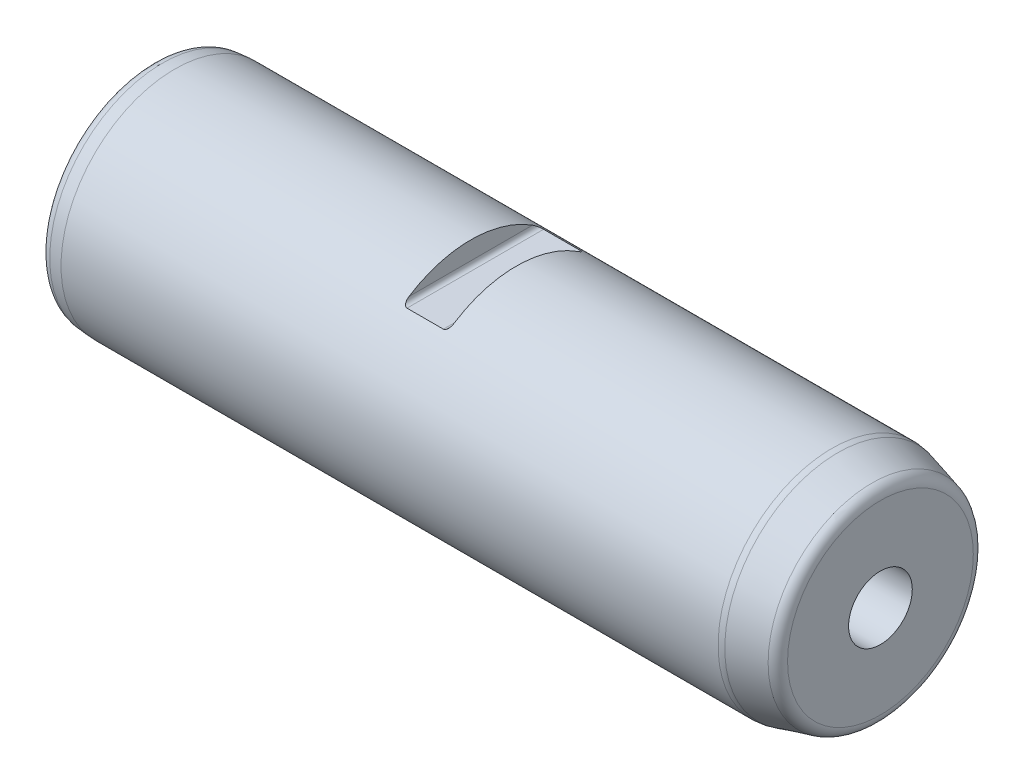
ISO-10303-21;
HEADER;
FILE_DESCRIPTION(('STEP AP214'),'2;1');
FILE_NAME('part.step','',(''),(''),'','','');
FILE_SCHEMA(('AUTOMOTIVE_DESIGN { 1 0 10303 214 1 1 1 1 }'));
ENDSEC;
DATA;
#1=APPLICATION_CONTEXT('core data for automotive mechanical design processes');
#2=APPLICATION_PROTOCOL_DEFINITION('international standard','automotive_design',2000,#1);
#3=PRODUCT_CONTEXT('',#1,'mechanical');
#4=PRODUCT('Part','Part','',(#3));
#5=PRODUCT_RELATED_PRODUCT_CATEGORY('part','',(#4));
#6=PRODUCT_DEFINITION_FORMATION('','',#4);
#7=PRODUCT_DEFINITION_CONTEXT('part definition',#1,'design');
#8=PRODUCT_DEFINITION('design','',#6,#7);
#9=PRODUCT_DEFINITION_SHAPE('','',#8);
#10=(LENGTH_UNIT() NAMED_UNIT(*) SI_UNIT(.MILLI.,.METRE.));
#11=(NAMED_UNIT(*) PLANE_ANGLE_UNIT() SI_UNIT($,.RADIAN.));
#12=(NAMED_UNIT(*) SI_UNIT($,.STERADIAN.) SOLID_ANGLE_UNIT());
#13=UNCERTAINTY_MEASURE_WITH_UNIT(LENGTH_MEASURE(1.E-05),#10,'distance_accuracy_value','');
#14=(GEOMETRIC_REPRESENTATION_CONTEXT(3) GLOBAL_UNCERTAINTY_ASSIGNED_CONTEXT((#13)) GLOBAL_UNIT_ASSIGNED_CONTEXT((#10,
#11,#12)) REPRESENTATION_CONTEXT('',''));
#15=CARTESIAN_POINT('',(0.,0.,0.));
#16=DIRECTION('',(0.,0.,1.));
#17=DIRECTION('',(1.,0.,0.));
#18=AXIS2_PLACEMENT_3D('',#15,#16,#17);
#19=CARTESIAN_POINT('',(0.,0.,0.));
#20=DIRECTION('',(1.,0.,0.));
#21=DIRECTION('',(0.,0.,-1.));
#22=AXIS2_PLACEMENT_3D('',#19,#20,#21);
#23=PLANE('',#22);
#24=CARTESIAN_POINT('',(0.,0.,0.));
#25=DIRECTION('',(1.,0.,0.));
#26=DIRECTION('',(0.,0.,-1.));
#27=AXIS2_PLACEMENT_3D('',#24,#25,#26);
#28=CIRCLE('',#27,22.2717287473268);
#29=CARTESIAN_POINT('',(0.,0.,-22.2717287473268));
#30=VERTEX_POINT('',#29);
#31=EDGE_CURVE('E160',#30,#30,#28,.F.);
#32=ORIENTED_EDGE('',*,*,#31,.T.);
#33=EDGE_LOOP('',(#32));
#34=FACE_BOUND('',#33,.T.);
#35=ADVANCED_FACE('F15',(#34),#23,.F.);
#36=CARTESIAN_POINT('',(0.,0.,0.));
#37=DIRECTION('',(-1.,0.,0.));
#38=DIRECTION('',(0.,0.,1.));
#39=AXIS2_PLACEMENT_3D('',#36,#37,#38);
#40=CYLINDRICAL_SURFACE('',#39,25.);
#41=CARTESIAN_POINT('',(79.,20.,-15.));
#42=CARTESIAN_POINT('',(79.0204326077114,19.9999962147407,-15.0000046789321));
#43=CARTESIAN_POINT('',(79.0408503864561,20.0006268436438,-14.99916423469));
#44=CARTESIAN_POINT('',(79.0814530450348,20.0031161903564,-14.9958444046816));
#45=CARTESIAN_POINT('',(79.1016381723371,20.0049734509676,-14.993366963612));
#46=CARTESIAN_POINT('',(79.1611193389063,20.0122659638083,-14.9836336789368));
#47=CARTESIAN_POINT('',(79.1998541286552,20.0194241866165,-14.9740740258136));
#48=CARTESIAN_POINT('',(79.274391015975,20.0376163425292,-14.9497209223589));
#49=CARTESIAN_POINT('',(79.3102051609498,20.048633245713,-14.9349504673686));
#50=CARTESIAN_POINT('',(79.378696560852,20.0737580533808,-14.9011638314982));
#51=CARTESIAN_POINT('',(79.411363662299,20.0878755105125,-14.8821345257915));
#52=CARTESIAN_POINT('',(79.4896711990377,20.1264955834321,-14.8298921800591));
#53=CARTESIAN_POINT('',(79.5330744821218,20.1525500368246,-14.7944897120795));
#54=CARTESIAN_POINT('',(79.612543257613,20.2080720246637,-14.7185614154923));
#55=CARTESIAN_POINT('',(79.6485941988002,20.2375461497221,-14.6780256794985));
#56=CARTESIAN_POINT('',(79.707944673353,20.2928022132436,-14.6015056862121));
#57=CARTESIAN_POINT('',(79.7323659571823,20.3182250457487,-14.5661150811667));
#58=CARTESIAN_POINT('',(79.7773623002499,20.3700125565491,-14.4936048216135));
#59=CARTESIAN_POINT('',(79.7979348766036,20.3963778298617,-14.4564840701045));
#60=CARTESIAN_POINT('',(79.8545876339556,20.4765627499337,-14.3429056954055));
#61=CARTESIAN_POINT('',(79.8854357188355,20.5313064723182,-14.2644598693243));
#62=CARTESIAN_POINT('',(79.926216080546,20.6210933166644,-14.1341533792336));
#63=CARTESIAN_POINT('',(79.9396653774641,20.655945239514,-14.0831742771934));
#64=CARTESIAN_POINT('',(79.9623501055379,20.7257206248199,-13.9802847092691));
#65=CARTESIAN_POINT('',(79.9715835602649,20.760644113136,-13.9283738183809));
#66=CARTESIAN_POINT('',(79.986039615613,20.829829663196,-13.8246889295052));
#67=CARTESIAN_POINT('',(79.9913190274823,20.8640939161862,-13.7729240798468));
#68=CARTESIAN_POINT('',(79.9982907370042,20.9323059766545,-13.6690320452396));
#69=CARTESIAN_POINT('',(79.9999872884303,20.9662541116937,-13.6169053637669));
#70=CARTESIAN_POINT('',(80.,21.,-13.5646599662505));
#71=B_SPLINE_CURVE_WITH_KNOTS('',3,(#41,#42,#43,#44,#45,#46,#47,#48,#49,#50,#51,#52,#53,#54,#55,
#56,#57,#58,#59,#60,#61,#62,#63,#64,#65,#66,#67,#68,#69,#70),.UNSPECIFIED.,.F.,.F.,(4,2,2,2,2,2,
2,2,2,2,2,2,2,2,4),(0.,0.0612433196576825,0.122414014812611,0.243243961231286,0.363547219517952,
0.48422645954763,0.66851208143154,0.853158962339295,1.00280656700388,1.15255038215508,
1.4530090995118,1.64250050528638,1.83208065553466,2.01888173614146,2.20546091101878),.UNSPECIFIED.);
#72=CARTESIAN_POINT('',(79.,20.,-15.));
#73=VERTEX_POINT('',#72);
#74=CARTESIAN_POINT('',(80.,21.,-13.5646599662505));
#75=VERTEX_POINT('',#74);
#76=EDGE_CURVE('E206',#73,#75,#71,.T.);
#77=ORIENTED_EDGE('',*,*,#76,.T.);
#78=CARTESIAN_POINT('',(80.,0.,0.));
#79=DIRECTION('',(1.,0.,0.));
#80=DIRECTION('',(0.,0.,-1.));
#81=AXIS2_PLACEMENT_3D('',#78,#79,#80);
#82=CIRCLE('',#81,25.);
#83=CARTESIAN_POINT('',(80.,21.,13.5646599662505));
#84=VERTEX_POINT('',#83);
#85=EDGE_CURVE('E9',#75,#84,#82,.T.);
#86=ORIENTED_EDGE('',*,*,#85,.T.);
#87=CARTESIAN_POINT('',(80.,21.,13.5646599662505));
#88=CARTESIAN_POINT('',(79.999955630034,20.9542327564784,13.6355224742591));
#89=CARTESIAN_POINT('',(79.9968527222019,20.9080699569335,13.7061939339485));
#90=CARTESIAN_POINT('',(79.9838958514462,20.8150990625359,13.8469758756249));
#91=CARTESIAN_POINT('',(79.9740089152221,20.7682889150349,13.9170819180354));
#92=CARTESIAN_POINT('',(79.9467162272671,20.6742032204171,14.056474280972));
#93=CARTESIAN_POINT('',(79.929243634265,20.6269272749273,14.1257475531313));
#94=CARTESIAN_POINT('',(79.8857890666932,20.5330392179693,14.2618757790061));
#95=CARTESIAN_POINT('',(79.8598269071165,20.4864258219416,14.3287359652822));
#96=CARTESIAN_POINT('',(79.8073455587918,20.4086672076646,14.4391617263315));
#97=CARTESIAN_POINT('',(79.78337733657,20.3771135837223,14.4836486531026));
#98=CARTESIAN_POINT('',(79.7299895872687,20.3153235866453,14.5701902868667));
#99=CARTESIAN_POINT('',(79.7005747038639,20.2850861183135,14.6122470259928));
#100=CARTESIAN_POINT('',(79.6352592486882,20.2264422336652,14.6933167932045));
#101=CARTESIAN_POINT('',(79.5993032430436,20.1980545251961,14.7322993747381));
#102=CARTESIAN_POINT('',(79.5203001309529,20.1446922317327,14.8051816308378));
#103=CARTESIAN_POINT('',(79.4772638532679,20.1197125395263,14.8390889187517));
#104=CARTESIAN_POINT('',(79.399061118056,20.0824152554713,14.8895010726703));
#105=CARTESIAN_POINT('',(79.365934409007,20.0686302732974,14.908068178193));
#106=CARTESIAN_POINT('',(79.296557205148,20.0442807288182,14.9407906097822));
#107=CARTESIAN_POINT('',(79.2603170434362,20.0337060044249,14.9549598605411));
#108=CARTESIAN_POINT('',(79.1874516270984,20.0170610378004,14.9772311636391));
#109=CARTESIAN_POINT('',(79.150978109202,20.0107598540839,14.9856445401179));
#110=CARTESIAN_POINT('',(79.0951306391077,20.0043553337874,14.9941915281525));
#111=CARTESIAN_POINT('',(79.0762205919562,20.0027279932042,14.9963621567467));
#112=CARTESIAN_POINT('',(79.0382110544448,20.0005483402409,14.999268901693));
#113=CARTESIAN_POINT('',(79.0191113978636,19.9999970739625,15.0000036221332));
#114=CARTESIAN_POINT('',(79.,20.,15.));
#115=B_SPLINE_CURVE_WITH_KNOTS('',3,(#87,#88,#89,#90,#91,#92,#93,#94,#95,#96,#97,#98,#99,#100,
#101,#102,#103,#104,#105,#106,#107,#108,#109,#110,#111,#112,#113,#114),.UNSPECIFIED.,.F.,.F.,(4,
2,2,2,2,2,2,2,2,2,2,2,2,4),(0.,0.253099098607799,0.507437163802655,0.764063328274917,
1.02009474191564,1.19857022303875,1.37689423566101,1.55680656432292,1.73644624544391,
1.85724328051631,1.97765384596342,2.09088655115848,2.14812113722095,2.20541133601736),.UNSPECIFIED.);
#116=CARTESIAN_POINT('',(79.,20.,15.));
#117=VERTEX_POINT('',#116);
#118=EDGE_CURVE('E23',#84,#117,#115,.T.);
#119=ORIENTED_EDGE('',*,*,#118,.T.);
#120=DIRECTION('',(-1.,0.,0.));
#121=VECTOR('',#120,1.);
#122=CARTESIAN_POINT('',(0.,20.,15.));
#123=LINE('',#122,#121);
#124=CARTESIAN_POINT('',(71.,20.,15.));
#125=VERTEX_POINT('',#124);
#126=EDGE_CURVE('E74',#117,#125,#123,.T.);
#127=ORIENTED_EDGE('',*,*,#126,.T.);
#128=CARTESIAN_POINT('',(71.,20.,15.));
#129=CARTESIAN_POINT('',(70.9795673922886,19.9999962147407,15.0000046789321));
#130=CARTESIAN_POINT('',(70.9591496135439,20.0006268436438,14.99916423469));
#131=CARTESIAN_POINT('',(70.9185469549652,20.0031161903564,14.9958444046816));
#132=CARTESIAN_POINT('',(70.8983618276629,20.0049734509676,14.993366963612));
#133=CARTESIAN_POINT('',(70.8388806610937,20.0122659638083,14.9836336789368));
#134=CARTESIAN_POINT('',(70.8001458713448,20.0194241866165,14.9740740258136));
#135=CARTESIAN_POINT('',(70.725608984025,20.0376163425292,14.9497209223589));
#136=CARTESIAN_POINT('',(70.6897948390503,20.048633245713,14.9349504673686));
#137=CARTESIAN_POINT('',(70.6213034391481,20.0737580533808,14.9011638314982));
#138=CARTESIAN_POINT('',(70.5886363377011,20.0878755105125,14.8821345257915));
#139=CARTESIAN_POINT('',(70.5103288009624,20.1264955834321,14.8298921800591));
#140=CARTESIAN_POINT('',(70.4669255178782,20.1525500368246,14.7944897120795));
#141=CARTESIAN_POINT('',(70.3874567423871,20.2080720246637,14.7185614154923));
#142=CARTESIAN_POINT('',(70.3514058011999,20.2375461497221,14.6780256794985));
#143=CARTESIAN_POINT('',(70.292055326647,20.2928022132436,14.6015056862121));
#144=CARTESIAN_POINT('',(70.2676340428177,20.3182250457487,14.5661150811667));
#145=CARTESIAN_POINT('',(70.2226376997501,20.3700125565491,14.4936048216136));
#146=CARTESIAN_POINT('',(70.2020651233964,20.3963778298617,14.4564840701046));
#147=CARTESIAN_POINT('',(70.1454123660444,20.4765627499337,14.3429056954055));
#148=CARTESIAN_POINT('',(70.1145642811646,20.5313064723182,14.2644598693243));
#149=CARTESIAN_POINT('',(70.0737839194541,20.6210933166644,14.1341533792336));
#150=CARTESIAN_POINT('',(70.060334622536,20.655945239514,14.0831742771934));
#151=CARTESIAN_POINT('',(70.0376498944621,20.7257206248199,13.9802847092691));
#152=CARTESIAN_POINT('',(70.0284164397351,20.760644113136,13.9283738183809));
#153=CARTESIAN_POINT('',(70.013960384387,20.829829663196,13.8246889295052));
#154=CARTESIAN_POINT('',(70.0086809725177,20.8640939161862,13.7729240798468));
#155=CARTESIAN_POINT('',(70.0017092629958,20.9323059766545,13.6690320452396));
#156=CARTESIAN_POINT('',(70.0000127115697,20.9662541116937,13.6169053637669));
#157=CARTESIAN_POINT('',(70.,21.,13.5646599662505));
#158=B_SPLINE_CURVE_WITH_KNOTS('',3,(#128,#129,#130,#131,#132,#133,#134,#135,#136,#137,#138,
#139,#140,#141,#142,#143,#144,#145,#146,#147,#148,#149,#150,#151,#152,#153,#154,#155,#156,#157),
.UNSPECIFIED.,.F.,.F.,(4,2,2,2,2,2,2,2,2,2,2,2,2,2,4),(0.,0.0612433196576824,0.122414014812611,
0.243243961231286,0.363547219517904,0.48422645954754,0.668512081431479,0.853158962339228,
1.00280656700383,1.15255038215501,1.45300909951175,1.64250050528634,1.83208065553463,
2.01888173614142,2.20546091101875),.UNSPECIFIED.);
#159=CARTESIAN_POINT('',(70.,21.,13.5646599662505));
#160=VERTEX_POINT('',#159);
#161=EDGE_CURVE('E65',#125,#160,#158,.T.);
#162=ORIENTED_EDGE('',*,*,#161,.T.);
#163=CARTESIAN_POINT('',(70.,0.,0.));
#164=DIRECTION('',(-1.,0.,0.));
#165=DIRECTION('',(0.,-1.,0.));
#166=AXIS2_PLACEMENT_3D('',#163,#164,#165);
#167=CIRCLE('',#166,25.);
#168=CARTESIAN_POINT('',(70.,21.,-13.5646599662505));
#169=VERTEX_POINT('',#168);
#170=EDGE_CURVE('E54',#160,#169,#167,.T.);
#171=ORIENTED_EDGE('',*,*,#170,.T.);
#172=CARTESIAN_POINT('',(70.,21.,-13.5646599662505));
#173=CARTESIAN_POINT('',(70.000044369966,20.9542327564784,-13.6355224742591));
#174=CARTESIAN_POINT('',(70.0031472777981,20.9080699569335,-13.7061939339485));
#175=CARTESIAN_POINT('',(70.0161041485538,20.8150990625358,-13.846975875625));
#176=CARTESIAN_POINT('',(70.0259910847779,20.7682889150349,-13.9170819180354));
#177=CARTESIAN_POINT('',(70.0532837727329,20.674203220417,-14.056474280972));
#178=CARTESIAN_POINT('',(70.070756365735,20.6269272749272,-14.1257475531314));
#179=CARTESIAN_POINT('',(70.1142109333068,20.5330392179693,-14.2618757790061));
#180=CARTESIAN_POINT('',(70.1401730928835,20.4864258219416,-14.3287359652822));
#181=CARTESIAN_POINT('',(70.1926544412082,20.4086672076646,-14.4391617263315));
#182=CARTESIAN_POINT('',(70.21662266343,20.3771135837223,-14.4836486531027));
#183=CARTESIAN_POINT('',(70.2700104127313,20.3153235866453,-14.5701902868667));
#184=CARTESIAN_POINT('',(70.2994252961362,20.2850861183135,-14.6122470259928));
#185=CARTESIAN_POINT('',(70.3647407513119,20.2264422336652,-14.6933167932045));
#186=CARTESIAN_POINT('',(70.4006967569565,20.1980545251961,-14.7322993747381));
#187=CARTESIAN_POINT('',(70.4796998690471,20.1446922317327,-14.8051816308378));
#188=CARTESIAN_POINT('',(70.5227361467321,20.1197125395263,-14.8390889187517));
#189=CARTESIAN_POINT('',(70.600938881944,20.0824152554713,-14.8895010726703));
#190=CARTESIAN_POINT('',(70.634065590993,20.0686302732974,-14.908068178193));
#191=CARTESIAN_POINT('',(70.7034427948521,20.0442807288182,-14.9407906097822));
#192=CARTESIAN_POINT('',(70.7396829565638,20.0337060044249,-14.9549598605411));
#193=CARTESIAN_POINT('',(70.8125483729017,20.0170610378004,-14.9772311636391));
#194=CARTESIAN_POINT('',(70.8490218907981,20.0107598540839,-14.9856445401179));
#195=CARTESIAN_POINT('',(70.9048693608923,20.0043553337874,-14.9941915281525));
#196=CARTESIAN_POINT('',(70.9237794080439,20.0027279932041,-14.9963621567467));
#197=CARTESIAN_POINT('',(70.9617889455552,20.0005483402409,-14.999268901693));
#198=CARTESIAN_POINT('',(70.9808886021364,19.9999970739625,-15.0000036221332));
#199=CARTESIAN_POINT('',(71.,20.,-15.));
#200=B_SPLINE_CURVE_WITH_KNOTS('',3,(#172,#173,#174,#175,#176,#177,#178,#179,#180,#181,#182,
#183,#184,#185,#186,#187,#188,#189,#190,#191,#192,#193,#194,#195,#196,#197,#198,#199),
.UNSPECIFIED.,.F.,.F.,(4,2,2,2,2,2,2,2,2,2,2,2,2,4),(0.,0.253099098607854,0.507437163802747,
0.764063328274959,1.02009474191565,1.19857022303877,1.37689423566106,1.55680656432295,
1.7364462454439,1.85724328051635,1.97765384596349,2.09088655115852,2.14812113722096,
2.20541133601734),.UNSPECIFIED.);
#201=CARTESIAN_POINT('',(71.,20.,-15.));
#202=VERTEX_POINT('',#201);
#203=EDGE_CURVE('E59',#169,#202,#200,.T.);
#204=ORIENTED_EDGE('',*,*,#203,.T.);
#205=DIRECTION('',(-1.,0.,0.));
#206=VECTOR('',#205,1.);
#207=CARTESIAN_POINT('',(0.,20.,-15.));
#208=LINE('',#207,#206);
#209=EDGE_CURVE('E75',#202,#73,#208,.F.);
#210=ORIENTED_EDGE('',*,*,#209,.T.);
#211=EDGE_LOOP('',(#77,#86,#119,#127,#162,#171,#204,#210));
#212=FACE_BOUND('',#211,.T.);
#213=CARTESIAN_POINT('',(5.00000000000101,0.,0.));
#214=DIRECTION('',(1.,0.,0.));
#215=DIRECTION('',(0.,0.,-1.));
#216=AXIS2_PLACEMENT_3D('',#213,#214,#215);
#217=CIRCLE('',#216,25.);
#218=CARTESIAN_POINT('',(5.00000000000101,0.,-25.));
#219=VERTEX_POINT('',#218);
#220=EDGE_CURVE('E159',#219,#219,#217,.T.);
#221=ORIENTED_EDGE('',*,*,#220,.T.);
#222=EDGE_LOOP('',(#221));
#223=FACE_BOUND('',#222,.T.);
#224=CARTESIAN_POINT('',(149.341737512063,0.,0.));
#225=DIRECTION('',(1.,0.,0.));
#226=DIRECTION('',(0.,0.,-1.));
#227=AXIS2_PLACEMENT_3D('',#224,#225,#226);
#228=CIRCLE('',#227,25.);
#229=CARTESIAN_POINT('',(149.341737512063,0.,-25.));
#230=VERTEX_POINT('',#229);
#231=EDGE_CURVE('E177',#230,#230,#228,.F.);
#232=ORIENTED_EDGE('',*,*,#231,.T.);
#233=EDGE_LOOP('',(#232));
#234=FACE_BOUND('',#233,.T.);
#235=ADVANCED_FACE('F71',(#212,#223,#234),#40,.T.);
#236=CARTESIAN_POINT('',(160.,0.,0.));
#237=DIRECTION('',(-1.,0.,0.));
#238=DIRECTION('',(0.,0.,1.));
#239=AXIS2_PLACEMENT_3D('',#236,#237,#238);
#240=CONICAL_SURFACE('',#239,22.3205080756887,0.261799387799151);
#241=CARTESIAN_POINT('',(158.147047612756,0.,0.));
#242=DIRECTION('',(1.,0.,0.));
#243=DIRECTION('',(0.,0.,-1.));
#244=AXIS2_PLACEMENT_3D('',#241,#242,#243);
#245=CIRCLE('',#244,22.817005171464);
#246=CARTESIAN_POINT('',(158.147047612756,0.,-22.817005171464));
#247=VERTEX_POINT('',#246);
#248=EDGE_CURVE('E165',#247,#247,#245,.F.);
#249=ORIENTED_EDGE('',*,*,#248,.T.);
#250=EDGE_LOOP('',(#249));
#251=FACE_BOUND('',#250,.T.);
#252=CARTESIAN_POINT('',(150.635832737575,0.,0.));
#253=DIRECTION('',(1.,0.,0.));
#254=DIRECTION('',(0.,0.,-1.));
#255=AXIS2_PLACEMENT_3D('',#252,#253,#254);
#256=CIRCLE('',#255,24.8296291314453);
#257=CARTESIAN_POINT('',(150.635832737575,0.,-24.8296291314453));
#258=VERTEX_POINT('',#257);
#259=EDGE_CURVE('E190',#258,#258,#256,.T.);
#260=ORIENTED_EDGE('',*,*,#259,.T.);
#261=EDGE_LOOP('',(#260));
#262=FACE_BOUND('',#261,.T.);
#263=ADVANCED_FACE('F122',(#251,#262),#240,.T.);
#264=CARTESIAN_POINT('',(160.,22.3205080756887,0.));
#265=DIRECTION('',(-1.,0.,0.));
#266=DIRECTION('',(0.,0.,1.));
#267=AXIS2_PLACEMENT_3D('',#264,#265,#266);
#268=PLANE('',#267);
#269=CARTESIAN_POINT('',(160.,0.,0.));
#270=DIRECTION('',(1.,0.,0.));
#271=DIRECTION('',(0.,0.,-1.));
#272=AXIS2_PLACEMENT_3D('',#269,#270,#271);
#273=CIRCLE('',#272,7.);
#274=CARTESIAN_POINT('',(160.,0.,-7.));
#275=VERTEX_POINT('',#274);
#276=EDGE_CURVE('E180',#275,#275,#273,.T.);
#277=ORIENTED_EDGE('',*,*,#276,.F.);
#278=EDGE_LOOP('',(#277));
#279=FACE_BOUND('',#278,.T.);
#280=CARTESIAN_POINT('',(160.,0.,0.));
#281=DIRECTION('',(-1.,0.,0.));
#282=DIRECTION('',(0.,0.,1.));
#283=AXIS2_PLACEMENT_3D('',#280,#281,#282);
#284=CIRCLE('',#283,20.4021906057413);
#285=CARTESIAN_POINT('',(160.,0.,20.4021906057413));
#286=VERTEX_POINT('',#285);
#287=EDGE_CURVE('E161',#286,#286,#284,.F.);
#288=ORIENTED_EDGE('',*,*,#287,.T.);
#289=EDGE_LOOP('',(#288));
#290=FACE_BOUND('',#289,.T.);
#291=ADVANCED_FACE('F119',(#279,#290),#268,.F.);
#292=CARTESIAN_POINT('',(149.341737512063,0.,0.));
#293=DIRECTION('',(1.,0.,0.));
#294=DIRECTION('',(0.,0.,-1.));
#295=AXIS2_PLACEMENT_3D('',#292,#293,#294);
#296=TOROIDAL_SURFACE('',#295,20.,5.);
#297=ORIENTED_EDGE('',*,*,#259,.F.);
#298=EDGE_LOOP('',(#297));
#299=FACE_BOUND('',#298,.T.);
#300=ORIENTED_EDGE('',*,*,#231,.F.);
#301=EDGE_LOOP('',(#300));
#302=FACE_BOUND('',#301,.T.);
#303=ADVANCED_FACE('F121',(#299,#302),#296,.T.);
#304=CARTESIAN_POINT('',(157.5,0.,0.));
#305=DIRECTION('',(-1.,0.,0.));
#306=DIRECTION('',(0.,0.,1.));
#307=AXIS2_PLACEMENT_3D('',#304,#305,#306);
#308=TOROIDAL_SURFACE('',#307,20.4021906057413,2.5);
#309=ORIENTED_EDGE('',*,*,#287,.F.);
#310=EDGE_LOOP('',(#309));
#311=FACE_BOUND('',#310,.T.);
#312=ORIENTED_EDGE('',*,*,#248,.F.);
#313=EDGE_LOOP('',(#312));
#314=FACE_BOUND('',#313,.T.);
#315=ADVANCED_FACE('F142',(#311,#314),#308,.T.);
#316=CARTESIAN_POINT('',(0.,0.,0.));
#317=DIRECTION('',(1.,0.,0.));
#318=DIRECTION('',(0.,0.,-1.));
#319=AXIS2_PLACEMENT_3D('',#316,#317,#318);
#320=CONICAL_SURFACE('',#319,24.5625566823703,0.0872664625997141);
#321=CARTESIAN_POINT('',(2.28211064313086,0.,0.));
#322=DIRECTION('',(1.,0.,0.));
#323=DIRECTION('',(0.,0.,-1.));
#324=AXIS2_PLACEMENT_3D('',#321,#322,#323);
#325=CIRCLE('',#324,24.7622154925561);
#326=CARTESIAN_POINT('',(2.28211064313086,0.,-24.7622154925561));
#327=VERTEX_POINT('',#326);
#328=EDGE_CURVE('E60',#327,#327,#325,.T.);
#329=ORIENTED_EDGE('',*,*,#328,.T.);
#330=EDGE_LOOP('',(#329));
#331=FACE_BOUND('',#330,.T.);
#332=ORIENTED_EDGE('',*,*,#220,.F.);
#333=EDGE_LOOP('',(#332));
#334=FACE_BOUND('',#333,.T.);
#335=ADVANCED_FACE('F145',(#331,#334),#320,.T.);
#336=CARTESIAN_POINT('',(2.5,0.,0.));
#337=DIRECTION('',(1.,0.,0.));
#338=DIRECTION('',(0.,0.,-1.));
#339=AXIS2_PLACEMENT_3D('',#336,#337,#338);
#340=TOROIDAL_SURFACE('',#339,22.2717287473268,2.5);
#341=ORIENTED_EDGE('',*,*,#328,.F.);
#342=EDGE_LOOP('',(#341));
#343=FACE_BOUND('',#342,.T.);
#344=ORIENTED_EDGE('',*,*,#31,.F.);
#345=EDGE_LOOP('',(#344));
#346=FACE_BOUND('',#345,.T.);
#347=ADVANCED_FACE('F17',(#343,#346),#340,.T.);
#348=CARTESIAN_POINT('',(136.,0.,0.));
#349=DIRECTION('',(1.,0.,0.));
#350=DIRECTION('',(0.,0.,-1.));
#351=AXIS2_PLACEMENT_3D('',#348,#349,#350);
#352=PLANE('',#351);
#353=CARTESIAN_POINT('',(136.,0.,0.));
#354=DIRECTION('',(1.,0.,0.));
#355=DIRECTION('',(0.,0.,-1.));
#356=AXIS2_PLACEMENT_3D('',#353,#354,#355);
#357=CIRCLE('',#356,7.);
#358=CARTESIAN_POINT('',(136.,0.,-7.));
#359=VERTEX_POINT('',#358);
#360=EDGE_CURVE('E173',#359,#359,#357,.T.);
#361=ORIENTED_EDGE('',*,*,#360,.T.);
#362=EDGE_LOOP('',(#361));
#363=FACE_BOUND('',#362,.T.);
#364=CARTESIAN_POINT('',(136.,0.,0.));
#365=DIRECTION('',(1.,0.,0.));
#366=DIRECTION('',(0.,0.,-1.));
#367=AXIS2_PLACEMENT_3D('',#364,#365,#366);
#368=CIRCLE('',#367,5.1);
#369=CARTESIAN_POINT('',(136.,0.,-5.1));
#370=VERTEX_POINT('',#369);
#371=EDGE_CURVE('E170',#370,#370,#368,.F.);
#372=ORIENTED_EDGE('',*,*,#371,.T.);
#373=EDGE_LOOP('',(#372));
#374=FACE_BOUND('',#373,.T.);
#375=ADVANCED_FACE('F103',(#363,#374),#352,.T.);
#376=CARTESIAN_POINT('',(136.,0.,0.));
#377=DIRECTION('',(1.,0.,0.));
#378=DIRECTION('',(0.,0.,-1.));
#379=AXIS2_PLACEMENT_3D('',#376,#377,#378);
#380=CYLINDRICAL_SURFACE('',#379,7.);
#381=ORIENTED_EDGE('',*,*,#360,.F.);
#382=EDGE_LOOP('',(#381));
#383=FACE_BOUND('',#382,.T.);
#384=ORIENTED_EDGE('',*,*,#276,.T.);
#385=EDGE_LOOP('',(#384));
#386=FACE_BOUND('',#385,.T.);
#387=ADVANCED_FACE('F106',(#383,#386),#380,.F.);
#388=CARTESIAN_POINT('',(130.,0.,0.));
#389=DIRECTION('',(1.,0.,0.));
#390=DIRECTION('',(0.,0.,-1.));
#391=AXIS2_PLACEMENT_3D('',#388,#389,#390);
#392=CONICAL_SURFACE('',#391,5.1,1.0471975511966);
#393=CARTESIAN_POINT('',(127.055513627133,0.,0.));
#394=VERTEX_POINT('',#393);
#395=VERTEX_LOOP('',#394);
#396=FACE_BOUND('',#395,.T.);
#397=CARTESIAN_POINT('',(130.,0.,0.));
#398=DIRECTION('',(1.,0.,0.));
#399=DIRECTION('',(0.,0.,-1.));
#400=AXIS2_PLACEMENT_3D('',#397,#398,#399);
#401=CIRCLE('',#400,5.1);
#402=CARTESIAN_POINT('',(130.,0.,-5.1));
#403=VERTEX_POINT('',#402);
#404=EDGE_CURVE('E172',#403,#403,#401,.T.);
#405=ORIENTED_EDGE('',*,*,#404,.T.);
#406=EDGE_LOOP('',(#405));
#407=FACE_BOUND('',#406,.T.);
#408=ADVANCED_FACE('F110',(#396,#407),#392,.F.);
#409=CARTESIAN_POINT('',(160.,0.,0.));
#410=DIRECTION('',(1.,0.,0.));
#411=DIRECTION('',(0.,0.,-1.));
#412=AXIS2_PLACEMENT_3D('',#409,#410,#411);
#413=CYLINDRICAL_SURFACE('',#412,5.1);
#414=ORIENTED_EDGE('',*,*,#404,.F.);
#415=EDGE_LOOP('',(#414));
#416=FACE_BOUND('',#415,.T.);
#417=ORIENTED_EDGE('',*,*,#371,.F.);
#418=EDGE_LOOP('',(#417));
#419=FACE_BOUND('',#418,.T.);
#420=ADVANCED_FACE('F112',(#416,#419),#413,.F.);
#421=CARTESIAN_POINT('',(80.,21.,-25.));
#422=DIRECTION('',(1.,0.,0.));
#423=DIRECTION('',(0.,0.,-1.));
#424=AXIS2_PLACEMENT_3D('',#421,#422,#423);
#425=PLANE('',#424);
#426=DIRECTION('',(0.,0.,1.));
#427=VECTOR('',#426,1.);
#428=CARTESIAN_POINT('',(80.,21.,-25.));
#429=LINE('',#428,#427);
#430=EDGE_CURVE('E184',#75,#84,#429,.T.);
#431=ORIENTED_EDGE('',*,*,#430,.T.);
#432=ORIENTED_EDGE('',*,*,#85,.F.);
#433=EDGE_LOOP('',(#431,#432));
#434=FACE_BOUND('',#433,.T.);
#435=ADVANCED_FACE('F115',(#434),#425,.F.);
#436=CARTESIAN_POINT('',(79.,21.,-25.));
#437=DIRECTION('',(0.,0.,1.));
#438=DIRECTION('',(1.,0.,0.));
#439=AXIS2_PLACEMENT_3D('',#436,#437,#438);
#440=CYLINDRICAL_SURFACE('',#439,1.);
#441=ORIENTED_EDGE('',*,*,#430,.F.);
#442=ORIENTED_EDGE('',*,*,#76,.F.);
#443=DIRECTION('',(0.,0.,1.));
#444=VECTOR('',#443,1.);
#445=CARTESIAN_POINT('',(79.,20.,-25.));
#446=LINE('',#445,#444);
#447=EDGE_CURVE('E199',#73,#117,#446,.T.);
#448=ORIENTED_EDGE('',*,*,#447,.T.);
#449=ORIENTED_EDGE('',*,*,#118,.F.);
#450=EDGE_LOOP('',(#441,#442,#448,#449));
#451=FACE_BOUND('',#450,.T.);
#452=ADVANCED_FACE('F217',(#451),#440,.F.);
#453=CARTESIAN_POINT('',(71.,20.,-25.));
#454=DIRECTION('',(0.,-1.,0.));
#455=DIRECTION('',(0.,0.,-1.));
#456=AXIS2_PLACEMENT_3D('',#453,#454,#455);
#457=PLANE('',#456);
#458=ORIENTED_EDGE('',*,*,#447,.F.);
#459=ORIENTED_EDGE('',*,*,#209,.F.);
#460=DIRECTION('',(0.,0.,1.));
#461=VECTOR('',#460,1.);
#462=CARTESIAN_POINT('',(71.,20.,-25.));
#463=LINE('',#462,#461);
#464=EDGE_CURVE('E67',#202,#125,#463,.T.);
#465=ORIENTED_EDGE('',*,*,#464,.T.);
#466=ORIENTED_EDGE('',*,*,#126,.F.);
#467=EDGE_LOOP('',(#458,#459,#465,#466));
#468=FACE_BOUND('',#467,.T.);
#469=ADVANCED_FACE('F98',(#468),#457,.F.);
#470=CARTESIAN_POINT('',(71.,21.,-25.));
#471=DIRECTION('',(0.,0.,1.));
#472=DIRECTION('',(1.,0.,0.));
#473=AXIS2_PLACEMENT_3D('',#470,#471,#472);
#474=CYLINDRICAL_SURFACE('',#473,1.);
#475=ORIENTED_EDGE('',*,*,#464,.F.);
#476=ORIENTED_EDGE('',*,*,#203,.F.);
#477=DIRECTION('',(0.,0.,1.));
#478=VECTOR('',#477,1.);
#479=CARTESIAN_POINT('',(70.,21.,-25.));
#480=LINE('',#479,#478);
#481=EDGE_CURVE('E29',#169,#160,#480,.T.);
#482=ORIENTED_EDGE('',*,*,#481,.T.);
#483=ORIENTED_EDGE('',*,*,#161,.F.);
#484=EDGE_LOOP('',(#475,#476,#482,#483));
#485=FACE_BOUND('',#484,.T.);
#486=ADVANCED_FACE('F64',(#485),#474,.F.);
#487=CARTESIAN_POINT('',(70.,25.,-25.));
#488=DIRECTION('',(-1.,0.,0.));
#489=DIRECTION('',(0.,-1.,0.));
#490=AXIS2_PLACEMENT_3D('',#487,#488,#489);
#491=PLANE('',#490);
#492=ORIENTED_EDGE('',*,*,#481,.F.);
#493=ORIENTED_EDGE('',*,*,#170,.F.);
#494=EDGE_LOOP('',(#492,#493));
#495=FACE_BOUND('',#494,.T.);
#496=ADVANCED_FACE('F55',(#495),#491,.F.);
#497=CLOSED_SHELL('',(#35,#235,#263,#291,#303,#315,#335,#347,#375,#387,#408,#420,#435,#452,#469,
#486,#496));
#498=MANIFOLD_SOLID_BREP('B1',#497);
#499=ADVANCED_BREP_SHAPE_REPRESENTATION('',(#18,#498),#14);
#500=SHAPE_DEFINITION_REPRESENTATION(#9,#499);
ENDSEC;
END-ISO-10303-21;
